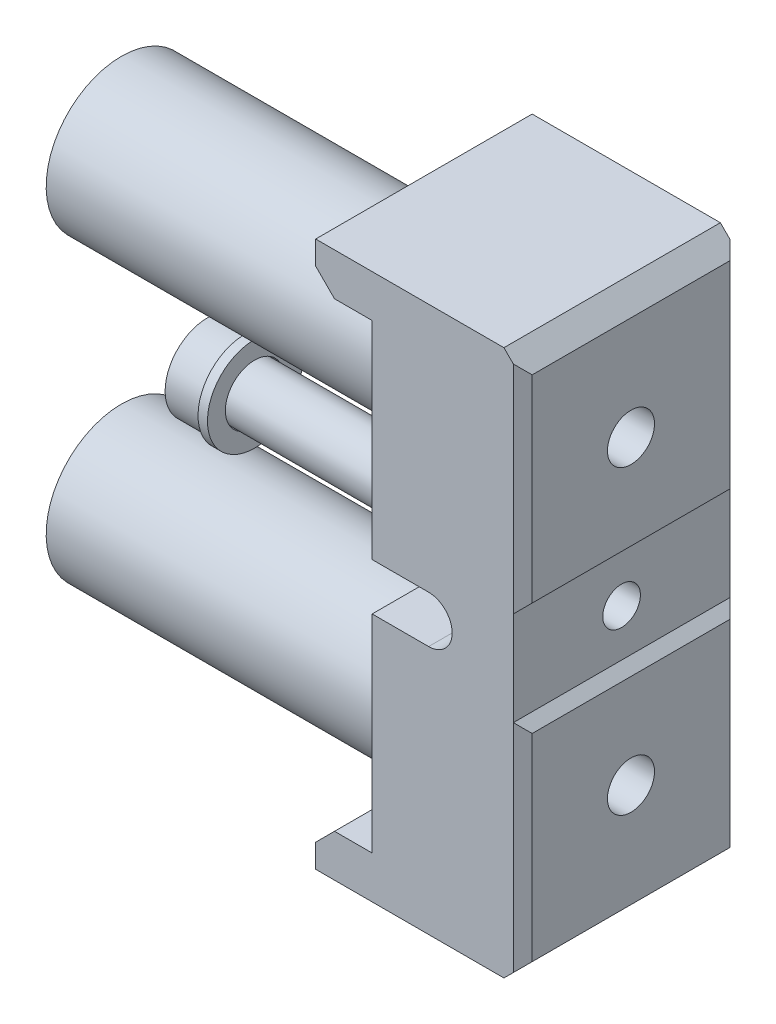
ISO-10303-21;
HEADER;
FILE_DESCRIPTION(('STEP AP214'),'2;1');
FILE_NAME('part.step','',(''),(''),'','','');
FILE_SCHEMA(('AUTOMOTIVE_DESIGN { 1 0 10303 214 1 1 1 1 }'));
ENDSEC;
DATA;
#1=APPLICATION_CONTEXT('core data for automotive mechanical design processes');
#2=APPLICATION_PROTOCOL_DEFINITION('international standard','automotive_design',2000,#1);
#3=PRODUCT_CONTEXT('',#1,'mechanical');
#4=PRODUCT('Part','Part','',(#3));
#5=PRODUCT_RELATED_PRODUCT_CATEGORY('part','',(#4));
#6=PRODUCT_DEFINITION_FORMATION('','',#4);
#7=PRODUCT_DEFINITION_CONTEXT('part definition',#1,'design');
#8=PRODUCT_DEFINITION('design','',#6,#7);
#9=PRODUCT_DEFINITION_SHAPE('','',#8);
#10=(LENGTH_UNIT() NAMED_UNIT(*) SI_UNIT(.MILLI.,.METRE.));
#11=(NAMED_UNIT(*) PLANE_ANGLE_UNIT() SI_UNIT($,.RADIAN.));
#12=(NAMED_UNIT(*) SI_UNIT($,.STERADIAN.) SOLID_ANGLE_UNIT());
#13=UNCERTAINTY_MEASURE_WITH_UNIT(LENGTH_MEASURE(1.E-05),#10,'distance_accuracy_value','');
#14=(GEOMETRIC_REPRESENTATION_CONTEXT(3) GLOBAL_UNCERTAINTY_ASSIGNED_CONTEXT((#13)) GLOBAL_UNIT_ASSIGNED_CONTEXT((#10,
#11,#12)) REPRESENTATION_CONTEXT('',''));
#15=CARTESIAN_POINT('',(0.,0.,0.));
#16=DIRECTION('',(0.,0.,1.));
#17=DIRECTION('',(1.,0.,0.));
#18=AXIS2_PLACEMENT_3D('',#15,#16,#17);
#19=CARTESIAN_POINT('',(-13.0966869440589,-16.,-20.));
#20=DIRECTION('',(1.,0.,0.));
#21=DIRECTION('',(0.,-1.,0.));
#22=AXIS2_PLACEMENT_3D('',#19,#20,#21);
#23=PLANE('',#22);
#24=CARTESIAN_POINT('',(-13.0966869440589,-16.,-20.));
#25=DIRECTION('',(-1.,0.,0.));
#26=DIRECTION('',(0.,1.,0.));
#27=AXIS2_PLACEMENT_3D('',#24,#25,#26);
#28=CIRCLE('',#27,4.25);
#29=CARTESIAN_POINT('',(-13.0966869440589,-11.75,-20.));
#30=VERTEX_POINT('',#29);
#31=EDGE_CURVE('E1061',#30,#30,#28,.T.);
#32=ORIENTED_EDGE('',*,*,#31,.T.);
#33=EDGE_LOOP('',(#32));
#34=FACE_BOUND('',#33,.T.);
#35=ADVANCED_FACE('F17',(#34),#23,.F.);
#36=CARTESIAN_POINT('',(-6.5966869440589,-16.,-20.));
#37=DIRECTION('',(-1.,0.,0.));
#38=DIRECTION('',(0.,1.,0.));
#39=AXIS2_PLACEMENT_3D('',#36,#37,#38);
#40=CYLINDRICAL_SURFACE('',#39,4.25);
#41=CARTESIAN_POINT('',(-23.9966869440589,-16.,-20.));
#42=DIRECTION('',(1.,0.,0.));
#43=DIRECTION('',(0.,-1.,0.));
#44=AXIS2_PLACEMENT_3D('',#41,#42,#43);
#45=CIRCLE('',#44,4.25);
#46=CARTESIAN_POINT('',(-23.9966869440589,-20.25,-20.));
#47=VERTEX_POINT('',#46);
#48=EDGE_CURVE('E231',#47,#47,#45,.T.);
#49=ORIENTED_EDGE('',*,*,#48,.F.);
#50=EDGE_LOOP('',(#49));
#51=FACE_BOUND('',#50,.T.);
#52=ORIENTED_EDGE('',*,*,#31,.F.);
#53=EDGE_LOOP('',(#52));
#54=FACE_BOUND('',#53,.T.);
#55=ADVANCED_FACE('F866',(#51,#54),#40,.F.);
#56=CARTESIAN_POINT('',(-23.9966869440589,-16.,-24.25));
#57=DIRECTION('',(-1.,0.,0.));
#58=DIRECTION('',(0.,1.,0.));
#59=AXIS2_PLACEMENT_3D('',#56,#57,#58);
#60=PLANE('',#59);
#61=ORIENTED_EDGE('',*,*,#48,.T.);
#62=EDGE_LOOP('',(#61));
#63=FACE_BOUND('',#62,.T.);
#64=CARTESIAN_POINT('',(-23.9966869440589,-16.,-20.));
#65=DIRECTION('',(1.,0.,0.));
#66=DIRECTION('',(0.,-1.,0.));
#67=AXIS2_PLACEMENT_3D('',#64,#65,#66);
#68=CIRCLE('',#67,6.25);
#69=CARTESIAN_POINT('',(-23.9966869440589,-22.25,-20.));
#70=VERTEX_POINT('',#69);
#71=EDGE_CURVE('E1063',#70,#70,#68,.T.);
#72=ORIENTED_EDGE('',*,*,#71,.F.);
#73=EDGE_LOOP('',(#72));
#74=FACE_BOUND('',#73,.T.);
#75=ADVANCED_FACE('F858',(#63,#74),#60,.T.);
#76=CARTESIAN_POINT('',(-6.5966869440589,-16.,-20.));
#77=DIRECTION('',(1.,0.,0.));
#78=DIRECTION('',(0.,-1.,0.));
#79=AXIS2_PLACEMENT_3D('',#76,#77,#78);
#80=CYLINDRICAL_SURFACE('',#79,6.25);
#81=ORIENTED_EDGE('',*,*,#71,.T.);
#82=EDGE_LOOP('',(#81));
#83=FACE_BOUND('',#82,.T.);
#84=CARTESIAN_POINT('',(-48.5966869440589,-16.,-20.));
#85=DIRECTION('',(-1.,0.,0.));
#86=DIRECTION('',(0.,1.,0.));
#87=AXIS2_PLACEMENT_3D('',#84,#85,#86);
#88=CIRCLE('',#87,6.25);
#89=CARTESIAN_POINT('',(-48.5966869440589,-9.75,-20.));
#90=VERTEX_POINT('',#89);
#91=EDGE_CURVE('E1080',#90,#90,#88,.F.);
#92=ORIENTED_EDGE('',*,*,#91,.F.);
#93=EDGE_LOOP('',(#92));
#94=FACE_BOUND('',#93,.T.);
#95=ADVANCED_FACE('F850',(#83,#94),#80,.F.);
#96=CARTESIAN_POINT('',(-48.5966869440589,-16.,-28.));
#97=DIRECTION('',(-1.,0.,0.));
#98=DIRECTION('',(0.,1.,0.));
#99=AXIS2_PLACEMENT_3D('',#96,#97,#98);
#100=PLANE('',#99);
#101=CARTESIAN_POINT('',(-48.5966869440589,-16.,-20.));
#102=DIRECTION('',(-1.,0.,0.));
#103=DIRECTION('',(0.,1.,0.));
#104=AXIS2_PLACEMENT_3D('',#101,#102,#103);
#105=CIRCLE('',#104,8.);
#106=CARTESIAN_POINT('',(-48.5966869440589,-8.,-20.));
#107=VERTEX_POINT('',#106);
#108=EDGE_CURVE('E1073',#107,#107,#105,.T.);
#109=ORIENTED_EDGE('',*,*,#108,.T.);
#110=EDGE_LOOP('',(#109));
#111=FACE_BOUND('',#110,.T.);
#112=ORIENTED_EDGE('',*,*,#91,.T.);
#113=EDGE_LOOP('',(#112));
#114=FACE_BOUND('',#113,.T.);
#115=ADVANCED_FACE('F842',(#111,#114),#100,.T.);
#116=CARTESIAN_POINT('',(-6.5966869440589,-16.,-20.));
#117=DIRECTION('',(-1.,0.,0.));
#118=DIRECTION('',(0.,1.,0.));
#119=AXIS2_PLACEMENT_3D('',#116,#117,#118);
#120=CYLINDRICAL_SURFACE('',#119,8.);
#121=ORIENTED_EDGE('',*,*,#108,.F.);
#122=EDGE_LOOP('',(#121));
#123=FACE_BOUND('',#122,.T.);
#124=CARTESIAN_POINT('',(-9.18492506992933,-16.,-20.));
#125=DIRECTION('',(-0.93969262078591,0.,-0.342020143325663));
#126=DIRECTION('',(-0.342020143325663,0.,0.939692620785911));
#127=AXIS2_PLACEMENT_3D('',#124,#125,#126);
#128=ELLIPSE('',#127,8.51342217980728,8.);
#129=CARTESIAN_POINT('',(-6.5966869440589,-12.3350457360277,-27.1111258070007));
#130=VERTEX_POINT('',#129);
#131=CARTESIAN_POINT('',(-10.458820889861,-8.80625271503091,-16.5));
#132=VERTEX_POINT('',#131);
#133=EDGE_CURVE('E1067',#130,#132,#128,.F.);
#134=ORIENTED_EDGE('',*,*,#133,.F.);
#135=CARTESIAN_POINT('',(-6.5966869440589,-16.,-20.));
#136=DIRECTION('',(-1.,0.,0.));
#137=DIRECTION('',(0.,1.,0.));
#138=AXIS2_PLACEMENT_3D('',#135,#136,#137);
#139=CIRCLE('',#138,8.);
#140=CARTESIAN_POINT('',(-6.5966869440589,-19.6649542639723,-27.1111258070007));
#141=VERTEX_POINT('',#140);
#142=EDGE_CURVE('E1076',#130,#141,#139,.T.);
#143=ORIENTED_EDGE('',*,*,#142,.T.);
#144=CARTESIAN_POINT('',(-10.458820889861,-23.193747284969,-16.5));
#145=VERTEX_POINT('',#144);
#146=EDGE_CURVE('E36',#145,#141,#128,.F.);
#147=ORIENTED_EDGE('',*,*,#146,.F.);
#148=EDGE_CURVE('E1065',#132,#145,#128,.F.);
#149=ORIENTED_EDGE('',*,*,#148,.F.);
#150=EDGE_LOOP('',(#134,#143,#147,#149));
#151=FACE_BOUND('',#150,.T.);
#152=ADVANCED_FACE('F835',(#123,#151),#120,.T.);
#153=CARTESIAN_POINT('',(-12.0966869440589,-1.,-12.));
#154=DIRECTION('',(-0.93969262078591,0.,-0.342020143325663));
#155=DIRECTION('',(0.342020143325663,0.,-0.93969262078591));
#156=AXIS2_PLACEMENT_3D('',#153,#154,#155);
#157=PLANE('',#156);
#158=DIRECTION('',(0.,-1.,0.));
#159=VECTOR('',#158,1.);
#160=CARTESIAN_POINT('',(-10.458820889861,-1.,-16.5));
#161=LINE('',#160,#159);
#162=EDGE_CURVE('E27',#132,#145,#161,.T.);
#163=ORIENTED_EDGE('',*,*,#162,.F.);
#164=ORIENTED_EDGE('',*,*,#148,.T.);
#165=EDGE_LOOP('',(#163,#164));
#166=FACE_BOUND('',#165,.T.);
#167=ADVANCED_FACE('F375',(#166),#157,.F.);
#168=CARTESIAN_POINT('',(-6.5966869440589,-16.,-20.));
#169=DIRECTION('',(1.,0.,0.));
#170=DIRECTION('',(0.,-1.,0.));
#171=AXIS2_PLACEMENT_3D('',#168,#169,#170);
#172=PLANE('',#171);
#173=DIRECTION('',(0.,1.,0.));
#174=VECTOR('',#173,1.);
#175=CARTESIAN_POINT('',(-6.5966869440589,-16.,-27.1111258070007));
#176=LINE('',#175,#174);
#177=EDGE_CURVE('E1078',#141,#130,#176,.T.);
#178=ORIENTED_EDGE('',*,*,#177,.F.);
#179=ORIENTED_EDGE('',*,*,#142,.F.);
#180=EDGE_LOOP('',(#178,#179));
#181=FACE_BOUND('',#180,.T.);
#182=ADVANCED_FACE('F372',(#181),#172,.T.);
#183=CARTESIAN_POINT('',(-9.18492506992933,-16.,-20.));
#184=DIRECTION('',(0.939692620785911,0.,0.342020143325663));
#185=DIRECTION('',(0.342020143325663,0.,-0.939692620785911));
#186=AXIS2_PLACEMENT_3D('',#183,#184,#185);
#187=ELLIPSE('',#186,2.66044443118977,2.5);
#188=CARTESIAN_POINT('',(-8.27499948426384,-16.,-22.5));
#189=VERTEX_POINT('',#188);
#190=EDGE_CURVE('E11',#189,#189,#187,.T.);
#191=ORIENTED_EDGE('',*,*,#190,.T.);
#192=EDGE_LOOP('',(#191));
#193=FACE_BOUND('',#192,.T.);
#194=ADVANCED_FACE('F362',(#193),#157,.F.);
#195=CARTESIAN_POINT('',(-39.458820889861,0.,-20.));
#196=DIRECTION('',(-1.,0.,0.));
#197=DIRECTION('',(0.,-1.,0.));
#198=AXIS2_PLACEMENT_3D('',#195,#196,#197);
#199=PLANE('',#198);
#200=CARTESIAN_POINT('',(-39.458820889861,0.,-20.));
#201=DIRECTION('',(-1.,0.,0.));
#202=DIRECTION('',(0.,-1.,0.));
#203=AXIS2_PLACEMENT_3D('',#200,#201,#202);
#204=CIRCLE('',#203,4.5);
#205=CARTESIAN_POINT('',(-39.458820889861,-4.5,-20.));
#206=VERTEX_POINT('',#205);
#207=EDGE_CURVE('E467',#206,#206,#204,.T.);
#208=ORIENTED_EDGE('',*,*,#207,.T.);
#209=EDGE_LOOP('',(#208));
#210=FACE_BOUND('',#209,.T.);
#211=ADVANCED_FACE('F347',(#210),#199,.T.);
#212=CARTESIAN_POINT('',(-35.458820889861,0.,-20.));
#213=DIRECTION('',(1.,0.,0.));
#214=DIRECTION('',(0.,1.,0.));
#215=AXIS2_PLACEMENT_3D('',#212,#213,#214);
#216=CYLINDRICAL_SURFACE('',#215,4.5);
#217=ORIENTED_EDGE('',*,*,#207,.F.);
#218=EDGE_LOOP('',(#217));
#219=FACE_BOUND('',#218,.T.);
#220=CARTESIAN_POINT('',(-35.458820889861,0.,-20.));
#221=DIRECTION('',(1.,0.,0.));
#222=DIRECTION('',(0.,1.,0.));
#223=AXIS2_PLACEMENT_3D('',#220,#221,#222);
#224=CIRCLE('',#223,4.5);
#225=CARTESIAN_POINT('',(-35.458820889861,4.5,-20.));
#226=VERTEX_POINT('',#225);
#227=EDGE_CURVE('E222',#226,#226,#224,.F.);
#228=ORIENTED_EDGE('',*,*,#227,.T.);
#229=EDGE_LOOP('',(#228));
#230=FACE_BOUND('',#229,.T.);
#231=ADVANCED_FACE('F262',(#219,#230),#216,.T.);
#232=CARTESIAN_POINT('',(-13.0966869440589,16.,-20.));
#233=DIRECTION('',(1.,0.,0.));
#234=DIRECTION('',(0.,-1.,0.));
#235=AXIS2_PLACEMENT_3D('',#232,#233,#234);
#236=PLANE('',#235);
#237=CARTESIAN_POINT('',(-13.0966869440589,16.,-20.));
#238=DIRECTION('',(-1.,0.,0.));
#239=DIRECTION('',(0.,1.,0.));
#240=AXIS2_PLACEMENT_3D('',#237,#238,#239);
#241=CIRCLE('',#240,4.25);
#242=CARTESIAN_POINT('',(-13.0966869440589,20.25,-20.));
#243=VERTEX_POINT('',#242);
#244=EDGE_CURVE('E1086',#243,#243,#241,.T.);
#245=ORIENTED_EDGE('',*,*,#244,.T.);
#246=EDGE_LOOP('',(#245));
#247=FACE_BOUND('',#246,.T.);
#248=ADVANCED_FACE('F250',(#247),#236,.F.);
#249=CARTESIAN_POINT('',(-35.458820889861,0.,-20.));
#250=DIRECTION('',(1.,0.,0.));
#251=DIRECTION('',(0.,-1.,0.));
#252=AXIS2_PLACEMENT_3D('',#249,#250,#251);
#253=PLANE('',#252);
#254=ORIENTED_EDGE('',*,*,#227,.F.);
#255=EDGE_LOOP('',(#254));
#256=FACE_BOUND('',#255,.T.);
#257=CARTESIAN_POINT('',(-35.458820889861,0.,-20.));
#258=DIRECTION('',(1.,0.,0.));
#259=DIRECTION('',(0.,-1.,0.));
#260=AXIS2_PLACEMENT_3D('',#257,#258,#259);
#261=CIRCLE('',#260,5.);
#262=CARTESIAN_POINT('',(-35.458820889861,-5.,-20.));
#263=VERTEX_POINT('',#262);
#264=EDGE_CURVE('E21',#263,#263,#261,.T.);
#265=ORIENTED_EDGE('',*,*,#264,.F.);
#266=EDGE_LOOP('',(#265));
#267=FACE_BOUND('',#266,.T.);
#268=ADVANCED_FACE('F247',(#256,#267),#253,.F.);
#269=CARTESIAN_POINT('',(-6.5966869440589,16.,-20.));
#270=DIRECTION('',(-1.,0.,0.));
#271=DIRECTION('',(0.,1.,0.));
#272=AXIS2_PLACEMENT_3D('',#269,#270,#271);
#273=CYLINDRICAL_SURFACE('',#272,4.25);
#274=CARTESIAN_POINT('',(-23.9966869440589,16.,-20.));
#275=DIRECTION('',(1.,0.,0.));
#276=DIRECTION('',(0.,-1.,0.));
#277=AXIS2_PLACEMENT_3D('',#274,#275,#276);
#278=CIRCLE('',#277,4.25);
#279=CARTESIAN_POINT('',(-23.9966869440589,11.75,-20.));
#280=VERTEX_POINT('',#279);
#281=EDGE_CURVE('E461',#280,#280,#278,.T.);
#282=ORIENTED_EDGE('',*,*,#281,.F.);
#283=EDGE_LOOP('',(#282));
#284=FACE_BOUND('',#283,.T.);
#285=ORIENTED_EDGE('',*,*,#244,.F.);
#286=EDGE_LOOP('',(#285));
#287=FACE_BOUND('',#286,.T.);
#288=ADVANCED_FACE('F249',(#284,#287),#273,.F.);
#289=CARTESIAN_POINT('',(-34.458820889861,0.,-20.));
#290=DIRECTION('',(-1.,0.,0.));
#291=DIRECTION('',(0.,1.,0.));
#292=AXIS2_PLACEMENT_3D('',#289,#290,#291);
#293=CYLINDRICAL_SURFACE('',#292,5.);
#294=CARTESIAN_POINT('',(-34.458820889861,0.,-20.));
#295=DIRECTION('',(1.,0.,0.));
#296=DIRECTION('',(0.,-1.,0.));
#297=AXIS2_PLACEMENT_3D('',#294,#295,#296);
#298=CIRCLE('',#297,5.);
#299=CARTESIAN_POINT('',(-34.458820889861,-5.,-20.));
#300=VERTEX_POINT('',#299);
#301=EDGE_CURVE('E235',#300,#300,#298,.T.);
#302=ORIENTED_EDGE('',*,*,#301,.F.);
#303=EDGE_LOOP('',(#302));
#304=FACE_BOUND('',#303,.T.);
#305=ORIENTED_EDGE('',*,*,#264,.T.);
#306=EDGE_LOOP('',(#305));
#307=FACE_BOUND('',#306,.T.);
#308=ADVANCED_FACE('F19',(#304,#307),#293,.T.);
#309=CARTESIAN_POINT('',(-12.0966869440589,31.,-12.));
#310=DIRECTION('',(-0.93969262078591,0.,-0.342020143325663));
#311=DIRECTION('',(0.342020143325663,0.,-0.93969262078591));
#312=AXIS2_PLACEMENT_3D('',#309,#310,#311);
#313=PLANE('',#312);
#314=CARTESIAN_POINT('',(-9.18492506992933,16.,-20.));
#315=DIRECTION('',(0.939692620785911,0.,0.342020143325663));
#316=DIRECTION('',(0.342020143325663,0.,-0.939692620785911));
#317=AXIS2_PLACEMENT_3D('',#314,#315,#316);
#318=ELLIPSE('',#317,2.66044443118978,2.5);
#319=CARTESIAN_POINT('',(-8.27499948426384,16.,-22.5));
#320=VERTEX_POINT('',#319);
#321=EDGE_CURVE('E228',#320,#320,#318,.T.);
#322=ORIENTED_EDGE('',*,*,#321,.T.);
#323=EDGE_LOOP('',(#322));
#324=FACE_BOUND('',#323,.T.);
#325=ADVANCED_FACE('F269',(#324),#313,.F.);
#326=CARTESIAN_POINT('',(-23.9966869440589,16.,-24.25));
#327=DIRECTION('',(-1.,0.,0.));
#328=DIRECTION('',(0.,1.,0.));
#329=AXIS2_PLACEMENT_3D('',#326,#327,#328);
#330=PLANE('',#329);
#331=ORIENTED_EDGE('',*,*,#281,.T.);
#332=EDGE_LOOP('',(#331));
#333=FACE_BOUND('',#332,.T.);
#334=CARTESIAN_POINT('',(-23.9966869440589,16.,-20.));
#335=DIRECTION('',(1.,0.,0.));
#336=DIRECTION('',(0.,-1.,0.));
#337=AXIS2_PLACEMENT_3D('',#334,#335,#336);
#338=CIRCLE('',#337,6.25);
#339=CARTESIAN_POINT('',(-23.9966869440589,9.75,-20.));
#340=VERTEX_POINT('',#339);
#341=EDGE_CURVE('E465',#340,#340,#338,.T.);
#342=ORIENTED_EDGE('',*,*,#341,.F.);
#343=EDGE_LOOP('',(#342));
#344=FACE_BOUND('',#343,.T.);
#345=ADVANCED_FACE('F261',(#333,#344),#330,.T.);
#346=CARTESIAN_POINT('',(-34.458820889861,0.,-20.));
#347=DIRECTION('',(1.,0.,0.));
#348=DIRECTION('',(0.,-1.,0.));
#349=AXIS2_PLACEMENT_3D('',#346,#347,#348);
#350=PLANE('',#349);
#351=ORIENTED_EDGE('',*,*,#301,.T.);
#352=EDGE_LOOP('',(#351));
#353=FACE_BOUND('',#352,.T.);
#354=CARTESIAN_POINT('',(-34.458820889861,0.,-20.));
#355=DIRECTION('',(1.,0.,0.));
#356=DIRECTION('',(0.,-1.,0.));
#357=AXIS2_PLACEMENT_3D('',#354,#355,#356);
#358=CIRCLE('',#357,3.1);
#359=CARTESIAN_POINT('',(-34.458820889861,-3.1,-20.));
#360=VERTEX_POINT('',#359);
#361=EDGE_CURVE('E233',#360,#360,#358,.T.);
#362=ORIENTED_EDGE('',*,*,#361,.F.);
#363=EDGE_LOOP('',(#362));
#364=FACE_BOUND('',#363,.T.);
#365=ADVANCED_FACE('F252',(#353,#364),#350,.T.);
#366=CARTESIAN_POINT('',(-16.458820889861,16.,-20.));
#367=DIRECTION('',(1.,0.,0.));
#368=DIRECTION('',(0.,-1.,0.));
#369=AXIS2_PLACEMENT_3D('',#366,#367,#368);
#370=CYLINDRICAL_SURFACE('',#369,2.5);
#371=CARTESIAN_POINT('',(5.54117911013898,16.,-20.));
#372=DIRECTION('',(1.,0.,0.));
#373=DIRECTION('',(0.,-1.,0.));
#374=AXIS2_PLACEMENT_3D('',#371,#372,#373);
#375=CIRCLE('',#374,2.5);
#376=CARTESIAN_POINT('',(5.54117911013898,13.5,-20.));
#377=VERTEX_POINT('',#376);
#378=EDGE_CURVE('E472',#377,#377,#375,.T.);
#379=ORIENTED_EDGE('',*,*,#378,.T.);
#380=EDGE_LOOP('',(#379));
#381=FACE_BOUND('',#380,.T.);
#382=ORIENTED_EDGE('',*,*,#321,.F.);
#383=EDGE_LOOP('',(#382));
#384=FACE_BOUND('',#383,.T.);
#385=ADVANCED_FACE('F273',(#381,#384),#370,.F.);
#386=CARTESIAN_POINT('',(1.541179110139,0.,-20.));
#387=DIRECTION('',(1.,0.,0.));
#388=DIRECTION('',(0.,1.,0.));
#389=AXIS2_PLACEMENT_3D('',#386,#387,#388);
#390=PLANE('',#389);
#391=CARTESIAN_POINT('',(1.541179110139,0.,-20.));
#392=DIRECTION('',(1.,0.,0.));
#393=DIRECTION('',(0.,1.,0.));
#394=AXIS2_PLACEMENT_3D('',#391,#392,#393);
#395=CIRCLE('',#394,2.);
#396=CARTESIAN_POINT('',(1.541179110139,2.,-20.));
#397=VERTEX_POINT('',#396);
#398=EDGE_CURVE('E1106',#397,#397,#395,.T.);
#399=ORIENTED_EDGE('',*,*,#398,.T.);
#400=EDGE_LOOP('',(#399));
#401=FACE_BOUND('',#400,.T.);
#402=ADVANCED_FACE('F357',(#401),#390,.T.);
#403=CARTESIAN_POINT('',(-6.5966869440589,16.,-20.));
#404=DIRECTION('',(1.,0.,0.));
#405=DIRECTION('',(0.,-1.,0.));
#406=AXIS2_PLACEMENT_3D('',#403,#404,#405);
#407=CYLINDRICAL_SURFACE('',#406,6.25);
#408=ORIENTED_EDGE('',*,*,#341,.T.);
#409=EDGE_LOOP('',(#408));
#410=FACE_BOUND('',#409,.T.);
#411=CARTESIAN_POINT('',(-48.5966869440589,16.,-20.));
#412=DIRECTION('',(-1.,0.,0.));
#413=DIRECTION('',(0.,1.,0.));
#414=AXIS2_PLACEMENT_3D('',#411,#412,#413);
#415=CIRCLE('',#414,6.25);
#416=CARTESIAN_POINT('',(-48.5966869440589,22.25,-20.));
#417=VERTEX_POINT('',#416);
#418=EDGE_CURVE('E1102',#417,#417,#415,.F.);
#419=ORIENTED_EDGE('',*,*,#418,.F.);
#420=EDGE_LOOP('',(#419));
#421=FACE_BOUND('',#420,.T.);
#422=ADVANCED_FACE('F345',(#410,#421),#407,.F.);
#423=CARTESIAN_POINT('',(-34.458820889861,0.,-20.));
#424=DIRECTION('',(-1.,0.,0.));
#425=DIRECTION('',(0.,1.,0.));
#426=AXIS2_PLACEMENT_3D('',#423,#424,#425);
#427=CYLINDRICAL_SURFACE('',#426,3.1);
#428=ORIENTED_EDGE('',*,*,#361,.T.);
#429=EDGE_LOOP('',(#428));
#430=FACE_BOUND('',#429,.T.);
#431=CARTESIAN_POINT('',(-35.458820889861,0.,-20.));
#432=DIRECTION('',(1.,0.,0.));
#433=DIRECTION('',(0.,0.,-1.));
#434=AXIS2_PLACEMENT_3D('',#431,#432,#433);
#435=CIRCLE('',#434,3.1);
#436=CARTESIAN_POINT('',(-35.458820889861,0.,-23.1));
#437=VERTEX_POINT('',#436);
#438=EDGE_CURVE('E460',#437,#437,#435,.F.);
#439=ORIENTED_EDGE('',*,*,#438,.T.);
#440=EDGE_LOOP('',(#439));
#441=FACE_BOUND('',#440,.T.);
#442=ADVANCED_FACE('F271',(#430,#441),#427,.F.);
#443=CARTESIAN_POINT('',(5.54117911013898,0.,-8.5));
#444=DIRECTION('',(-1.,0.,0.));
#445=DIRECTION('',(0.,1.,0.));
#446=AXIS2_PLACEMENT_3D('',#443,#444,#445);
#447=PLANE('',#446);
#448=ORIENTED_EDGE('',*,*,#378,.F.);
#449=EDGE_LOOP('',(#448));
#450=FACE_BOUND('',#449,.T.);
#451=DIRECTION('',(0.,0.,1.));
#452=VECTOR('',#451,1.);
#453=CARTESIAN_POINT('',(5.54117911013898,27.,-8.5));
#454=LINE('',#453,#452);
#455=CARTESIAN_POINT('',(5.54117911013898,27.,-30.5));
#456=VERTEX_POINT('',#455);
#457=CARTESIAN_POINT('',(5.54117911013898,27.,-9.5));
#458=VERTEX_POINT('',#457);
#459=EDGE_CURVE('E578',#456,#458,#454,.T.);
#460=ORIENTED_EDGE('',*,*,#459,.T.);
#461=DIRECTION('',(0.,-1.,0.));
#462=VECTOR('',#461,1.);
#463=CARTESIAN_POINT('',(5.54117911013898,0.,-9.5));
#464=LINE('',#463,#462);
#465=CARTESIAN_POINT('',(5.54117911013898,6.,-9.5));
#466=VERTEX_POINT('',#465);
#467=EDGE_CURVE('E587',#458,#466,#464,.T.);
#468=ORIENTED_EDGE('',*,*,#467,.T.);
#469=DIRECTION('',(0.,0.,-1.));
#470=VECTOR('',#469,1.);
#471=CARTESIAN_POINT('',(5.54117911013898,6.,-8.5));
#472=LINE('',#471,#470);
#473=CARTESIAN_POINT('',(5.54117911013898,6.,-30.5));
#474=VERTEX_POINT('',#473);
#475=EDGE_CURVE('E508',#466,#474,#472,.T.);
#476=ORIENTED_EDGE('',*,*,#475,.T.);
#477=DIRECTION('',(0.,1.,0.));
#478=VECTOR('',#477,1.);
#479=CARTESIAN_POINT('',(5.54117911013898,0.,-30.5));
#480=LINE('',#479,#478);
#481=EDGE_CURVE('E584',#474,#456,#480,.T.);
#482=ORIENTED_EDGE('',*,*,#481,.T.);
#483=EDGE_LOOP('',(#460,#468,#476,#482));
#484=FACE_BOUND('',#483,.T.);
#485=ADVANCED_FACE('F344',(#450,#484),#447,.F.);
#486=CARTESIAN_POINT('',(5.54117911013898,6.,-8.5));
#487=DIRECTION('',(-0.707106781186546,0.707106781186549,0.));
#488=DIRECTION('',(0.707106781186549,0.707106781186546,0.));
#489=AXIS2_PLACEMENT_3D('',#486,#487,#488);
#490=PLANE('',#489);
#491=ORIENTED_EDGE('',*,*,#475,.F.);
#492=DIRECTION('',(0.577350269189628,0.577350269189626,-0.577350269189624));
#493=VECTOR('',#492,1.);
#494=CARTESIAN_POINT('',(3.54117911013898,4.,-7.5));
#495=LINE('',#494,#493);
#496=CARTESIAN_POINT('',(4.54117911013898,5.,-8.5));
#497=VERTEX_POINT('',#496);
#498=EDGE_CURVE('E592',#466,#497,#495,.F.);
#499=ORIENTED_EDGE('',*,*,#498,.T.);
#500=DIRECTION('',(0.,0.,-1.));
#501=VECTOR('',#500,1.);
#502=CARTESIAN_POINT('',(4.54117911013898,5.,-8.5));
#503=LINE('',#502,#501);
#504=CARTESIAN_POINT('',(4.54117911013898,5.,-31.5));
#505=VERTEX_POINT('',#504);
#506=EDGE_CURVE('E512',#497,#505,#503,.T.);
#507=ORIENTED_EDGE('',*,*,#506,.T.);
#508=DIRECTION('',(-0.577350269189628,-0.577350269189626,-0.577350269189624));
#509=VECTOR('',#508,1.);
#510=CARTESIAN_POINT('',(3.54117911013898,4.,-32.5));
#511=LINE('',#510,#509);
#512=EDGE_CURVE('E590',#505,#474,#511,.F.);
#513=ORIENTED_EDGE('',*,*,#512,.T.);
#514=EDGE_LOOP('',(#491,#499,#507,#513));
#515=FACE_BOUND('',#514,.T.);
#516=ADVANCED_FACE('F353',(#515),#490,.F.);
#517=CARTESIAN_POINT('',(-16.458820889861,0.,-20.));
#518=DIRECTION('',(1.,0.,0.));
#519=DIRECTION('',(0.,-1.,0.));
#520=AXIS2_PLACEMENT_3D('',#517,#518,#519);
#521=CYLINDRICAL_SURFACE('',#520,2.);
#522=ORIENTED_EDGE('',*,*,#398,.F.);
#523=EDGE_LOOP('',(#522));
#524=FACE_BOUND('',#523,.T.);
#525=CARTESIAN_POINT('',(4.54117911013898,0.,-20.));
#526=DIRECTION('',(1.,0.,0.));
#527=DIRECTION('',(0.,-1.,0.));
#528=AXIS2_PLACEMENT_3D('',#525,#526,#527);
#529=CIRCLE('',#528,2.);
#530=CARTESIAN_POINT('',(4.54117911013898,-2.,-20.));
#531=VERTEX_POINT('',#530);
#532=EDGE_CURVE('E237',#531,#531,#529,.T.);
#533=ORIENTED_EDGE('',*,*,#532,.T.);
#534=EDGE_LOOP('',(#533));
#535=FACE_BOUND('',#534,.T.);
#536=ADVANCED_FACE('F332',(#524,#535),#521,.F.);
#537=CARTESIAN_POINT('',(5.54117911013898,0.,-30.5));
#538=DIRECTION('',(-0.707106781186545,0.,0.70710678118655));
#539=DIRECTION('',(0.,1.,0.));
#540=AXIS2_PLACEMENT_3D('',#537,#538,#539);
#541=PLANE('',#540);
#542=ORIENTED_EDGE('',*,*,#512,.F.);
#543=DIRECTION('',(0.,-1.,0.));
#544=VECTOR('',#543,1.);
#545=CARTESIAN_POINT('',(4.54117911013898,-29.,-31.5));
#546=LINE('',#545,#544);
#547=CARTESIAN_POINT('',(4.54117911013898,28.,-31.5));
#548=VERTEX_POINT('',#547);
#549=EDGE_CURVE('E616',#548,#505,#546,.T.);
#550=ORIENTED_EDGE('',*,*,#549,.F.);
#551=DIRECTION('',(-0.577350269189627,0.577350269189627,-0.577350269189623));
#552=VECTOR('',#551,1.);
#553=CARTESIAN_POINT('',(12.8745124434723,19.6666666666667,-23.1666666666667));
#554=LINE('',#553,#552);
#555=EDGE_CURVE('E598',#456,#548,#554,.T.);
#556=ORIENTED_EDGE('',*,*,#555,.F.);
#557=ORIENTED_EDGE('',*,*,#481,.F.);
#558=EDGE_LOOP('',(#542,#550,#556,#557));
#559=FACE_BOUND('',#558,.T.);
#560=ADVANCED_FACE('F328',(#559),#541,.F.);
#561=CARTESIAN_POINT('',(-48.5966869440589,16.,-28.));
#562=DIRECTION('',(-1.,0.,0.));
#563=DIRECTION('',(0.,1.,0.));
#564=AXIS2_PLACEMENT_3D('',#561,#562,#563);
#565=PLANE('',#564);
#566=CARTESIAN_POINT('',(-48.5966869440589,16.,-20.));
#567=DIRECTION('',(-1.,0.,0.));
#568=DIRECTION('',(0.,1.,0.));
#569=AXIS2_PLACEMENT_3D('',#566,#567,#568);
#570=CIRCLE('',#569,8.);
#571=CARTESIAN_POINT('',(-48.5966869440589,24.,-20.));
#572=VERTEX_POINT('',#571);
#573=EDGE_CURVE('E1092',#572,#572,#570,.T.);
#574=ORIENTED_EDGE('',*,*,#573,.T.);
#575=EDGE_LOOP('',(#574));
#576=FACE_BOUND('',#575,.T.);
#577=ORIENTED_EDGE('',*,*,#418,.T.);
#578=EDGE_LOOP('',(#577));
#579=FACE_BOUND('',#578,.T.);
#580=ADVANCED_FACE('F331',(#576,#579),#565,.T.);
#581=CARTESIAN_POINT('',(-35.458820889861,0.,-17.));
#582=DIRECTION('',(1.,0.,0.));
#583=DIRECTION('',(0.,1.,0.));
#584=AXIS2_PLACEMENT_3D('',#581,#582,#583);
#585=PLANE('',#584);
#586=CARTESIAN_POINT('',(-35.458820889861,0.,-20.));
#587=DIRECTION('',(1.,0.,0.));
#588=DIRECTION('',(0.,1.,0.));
#589=AXIS2_PLACEMENT_3D('',#586,#587,#588);
#590=CIRCLE('',#589,3.);
#591=CARTESIAN_POINT('',(-35.458820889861,3.,-20.));
#592=VERTEX_POINT('',#591);
#593=EDGE_CURVE('E219',#592,#592,#590,.T.);
#594=ORIENTED_EDGE('',*,*,#593,.F.);
#595=EDGE_LOOP('',(#594));
#596=FACE_BOUND('',#595,.T.);
#597=ORIENTED_EDGE('',*,*,#438,.F.);
#598=EDGE_LOOP('',(#597));
#599=FACE_BOUND('',#598,.T.);
#600=ADVANCED_FACE('F326',(#596,#599),#585,.T.);
#601=CARTESIAN_POINT('',(5.54117911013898,0.,-30.5));
#602=DIRECTION('',(-0.707106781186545,0.,0.70710678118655));
#603=DIRECTION('',(0.,1.,0.));
#604=AXIS2_PLACEMENT_3D('',#601,#602,#603);
#605=PLANE('',#604);
#606=DIRECTION('',(-0.577350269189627,-0.577350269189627,-0.577350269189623));
#607=VECTOR('',#606,1.);
#608=CARTESIAN_POINT('',(12.8745124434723,-19.6666666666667,-23.1666666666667));
#609=LINE('',#608,#607);
#610=CARTESIAN_POINT('',(4.54117911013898,-28.,-31.5));
#611=VERTEX_POINT('',#610);
#612=CARTESIAN_POINT('',(5.54117911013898,-27.,-30.5));
#613=VERTEX_POINT('',#612);
#614=EDGE_CURVE('E608',#611,#613,#609,.F.);
#615=ORIENTED_EDGE('',*,*,#614,.F.);
#616=DIRECTION('',(0.,-1.,0.));
#617=VECTOR('',#616,1.);
#618=CARTESIAN_POINT('',(4.54117911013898,-29.,-31.5));
#619=LINE('',#618,#617);
#620=CARTESIAN_POINT('',(4.54117911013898,-5.,-31.5));
#621=VERTEX_POINT('',#620);
#622=EDGE_CURVE('E618',#621,#611,#619,.T.);
#623=ORIENTED_EDGE('',*,*,#622,.F.);
#624=DIRECTION('',(0.577350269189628,-0.577350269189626,0.577350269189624));
#625=VECTOR('',#624,1.);
#626=CARTESIAN_POINT('',(3.54117911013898,-4.,-32.5));
#627=LINE('',#626,#625);
#628=CARTESIAN_POINT('',(5.54117911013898,-6.,-30.5));
#629=VERTEX_POINT('',#628);
#630=EDGE_CURVE('E612',#629,#621,#627,.F.);
#631=ORIENTED_EDGE('',*,*,#630,.F.);
#632=DIRECTION('',(0.,1.,0.));
#633=VECTOR('',#632,1.);
#634=CARTESIAN_POINT('',(5.54117911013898,0.,-30.5));
#635=LINE('',#634,#633);
#636=EDGE_CURVE('E602',#613,#629,#635,.T.);
#637=ORIENTED_EDGE('',*,*,#636,.F.);
#638=EDGE_LOOP('',(#615,#623,#631,#637));
#639=FACE_BOUND('',#638,.T.);
#640=ADVANCED_FACE('F316',(#639),#605,.F.);
#641=CARTESIAN_POINT('',(5.54117911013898,27.,-8.5));
#642=DIRECTION('',(-0.707106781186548,-0.707106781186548,0.));
#643=DIRECTION('',(0.,0.,1.));
#644=AXIS2_PLACEMENT_3D('',#641,#642,#643);
#645=PLANE('',#644);
#646=DIRECTION('',(0.707106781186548,-0.707106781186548,0.));
#647=VECTOR('',#646,1.);
#648=CARTESIAN_POINT('',(5.54117911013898,27.,-8.5));
#649=LINE('',#648,#647);
#650=CARTESIAN_POINT('',(4.54117911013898,28.,-8.5));
#651=VERTEX_POINT('',#650);
#652=CARTESIAN_POINT('',(3.54117911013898,29.,-8.5));
#653=VERTEX_POINT('',#652);
#654=EDGE_CURVE('E573',#651,#653,#649,.F.);
#655=ORIENTED_EDGE('',*,*,#654,.F.);
#656=DIRECTION('',(0.577350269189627,-0.577350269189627,-0.577350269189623));
#657=VECTOR('',#656,1.);
#658=CARTESIAN_POINT('',(5.20784577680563,27.3333333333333,-9.16666666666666));
#659=LINE('',#658,#657);
#660=EDGE_CURVE('E600',#651,#458,#659,.T.);
#661=ORIENTED_EDGE('',*,*,#660,.T.);
#662=ORIENTED_EDGE('',*,*,#459,.F.);
#663=ORIENTED_EDGE('',*,*,#555,.T.);
#664=DIRECTION('',(-0.707106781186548,0.707106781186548,0.));
#665=VECTOR('',#664,1.);
#666=CARTESIAN_POINT('',(5.54117911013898,27.,-31.5));
#667=LINE('',#666,#665);
#668=CARTESIAN_POINT('',(3.54117911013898,29.,-31.5));
#669=VERTEX_POINT('',#668);
#670=EDGE_CURVE('E566',#669,#548,#667,.F.);
#671=ORIENTED_EDGE('',*,*,#670,.F.);
#672=DIRECTION('',(0.,0.,-1.));
#673=VECTOR('',#672,1.);
#674=CARTESIAN_POINT('',(3.54117911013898,29.,-8.5));
#675=LINE('',#674,#673);
#676=EDGE_CURVE('E581',#653,#669,#675,.T.);
#677=ORIENTED_EDGE('',*,*,#676,.F.);
#678=EDGE_LOOP('',(#655,#661,#662,#663,#671,#677));
#679=FACE_BOUND('',#678,.T.);
#680=ADVANCED_FACE('F312',(#679),#645,.F.);
#681=CARTESIAN_POINT('',(5.54117911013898,0.,-9.5));
#682=DIRECTION('',(-0.707106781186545,0.,-0.70710678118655));
#683=DIRECTION('',(0.,-1.,0.));
#684=AXIS2_PLACEMENT_3D('',#681,#682,#683);
#685=PLANE('',#684);
#686=ORIENTED_EDGE('',*,*,#660,.F.);
#687=DIRECTION('',(0.,1.,0.));
#688=VECTOR('',#687,1.);
#689=CARTESIAN_POINT('',(4.54117911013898,-29.,-8.5));
#690=LINE('',#689,#688);
#691=EDGE_CURVE('E596',#497,#651,#690,.T.);
#692=ORIENTED_EDGE('',*,*,#691,.F.);
#693=ORIENTED_EDGE('',*,*,#498,.F.);
#694=ORIENTED_EDGE('',*,*,#467,.F.);
#695=EDGE_LOOP('',(#686,#692,#693,#694));
#696=FACE_BOUND('',#695,.T.);
#697=ADVANCED_FACE('F315',(#696),#685,.F.);
#698=CARTESIAN_POINT('',(4.54117911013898,5.,-8.5));
#699=DIRECTION('',(-1.,0.,0.));
#700=DIRECTION('',(0.,1.,0.));
#701=AXIS2_PLACEMENT_3D('',#698,#699,#700);
#702=PLANE('',#701);
#703=ORIENTED_EDGE('',*,*,#532,.F.);
#704=EDGE_LOOP('',(#703));
#705=FACE_BOUND('',#704,.T.);
#706=DIRECTION('',(0.,1.,0.));
#707=VECTOR('',#706,1.);
#708=CARTESIAN_POINT('',(4.54117911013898,5.,-31.5));
#709=LINE('',#708,#707);
#710=EDGE_CURVE('E501',#621,#505,#709,.T.);
#711=ORIENTED_EDGE('',*,*,#710,.T.);
#712=ORIENTED_EDGE('',*,*,#506,.F.);
#713=DIRECTION('',(0.,1.,0.));
#714=VECTOR('',#713,1.);
#715=CARTESIAN_POINT('',(4.54117911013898,5.,-8.5));
#716=LINE('',#715,#714);
#717=CARTESIAN_POINT('',(4.54117911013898,-5.,-8.5));
#718=VERTEX_POINT('',#717);
#719=EDGE_CURVE('E502',#718,#497,#716,.T.);
#720=ORIENTED_EDGE('',*,*,#719,.F.);
#721=DIRECTION('',(0.,0.,-1.));
#722=VECTOR('',#721,1.);
#723=CARTESIAN_POINT('',(4.54117911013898,-5.,-8.5));
#724=LINE('',#723,#722);
#725=EDGE_CURVE('E515',#718,#621,#724,.T.);
#726=ORIENTED_EDGE('',*,*,#725,.T.);
#727=EDGE_LOOP('',(#711,#712,#720,#726));
#728=FACE_BOUND('',#727,.T.);
#729=ADVANCED_FACE('F305',(#705,#728),#702,.F.);
#730=CARTESIAN_POINT('',(5.54117911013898,0.,-9.5));
#731=DIRECTION('',(-0.707106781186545,0.,-0.70710678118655));
#732=DIRECTION('',(0.,-1.,0.));
#733=AXIS2_PLACEMENT_3D('',#730,#731,#732);
#734=PLANE('',#733);
#735=DIRECTION('',(-0.577350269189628,0.577350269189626,0.577350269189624));
#736=VECTOR('',#735,1.);
#737=CARTESIAN_POINT('',(3.54117911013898,-4.,-7.5));
#738=LINE('',#737,#736);
#739=CARTESIAN_POINT('',(5.54117911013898,-6.,-9.5));
#740=VERTEX_POINT('',#739);
#741=EDGE_CURVE('E614',#718,#740,#738,.F.);
#742=ORIENTED_EDGE('',*,*,#741,.F.);
#743=DIRECTION('',(0.,1.,0.));
#744=VECTOR('',#743,1.);
#745=CARTESIAN_POINT('',(4.54117911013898,-29.,-8.5));
#746=LINE('',#745,#744);
#747=CARTESIAN_POINT('',(4.54117911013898,-28.,-8.5));
#748=VERTEX_POINT('',#747);
#749=EDGE_CURVE('E594',#748,#718,#746,.T.);
#750=ORIENTED_EDGE('',*,*,#749,.F.);
#751=DIRECTION('',(0.577350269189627,0.577350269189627,-0.577350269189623));
#752=VECTOR('',#751,1.);
#753=CARTESIAN_POINT('',(5.20784577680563,-27.3333333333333,-9.16666666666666));
#754=LINE('',#753,#752);
#755=CARTESIAN_POINT('',(5.54117911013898,-27.,-9.5));
#756=VERTEX_POINT('',#755);
#757=EDGE_CURVE('E610',#756,#748,#754,.F.);
#758=ORIENTED_EDGE('',*,*,#757,.F.);
#759=DIRECTION('',(0.,-1.,0.));
#760=VECTOR('',#759,1.);
#761=CARTESIAN_POINT('',(5.54117911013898,0.,-9.5));
#762=LINE('',#761,#760);
#763=EDGE_CURVE('E605',#740,#756,#762,.T.);
#764=ORIENTED_EDGE('',*,*,#763,.F.);
#765=EDGE_LOOP('',(#742,#750,#758,#764));
#766=FACE_BOUND('',#765,.T.);
#767=ADVANCED_FACE('F310',(#766),#734,.F.);
#768=CARTESIAN_POINT('',(5.54117911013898,-27.,-8.5));
#769=DIRECTION('',(0.707106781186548,-0.707106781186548,0.));
#770=DIRECTION('',(0.,0.,1.));
#771=AXIS2_PLACEMENT_3D('',#768,#769,#770);
#772=PLANE('',#771);
#773=DIRECTION('',(0.,0.,-1.));
#774=VECTOR('',#773,1.);
#775=CARTESIAN_POINT('',(5.54117911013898,-27.,-31.5));
#776=LINE('',#775,#774);
#777=EDGE_CURVE('E561',#756,#613,#776,.T.);
#778=ORIENTED_EDGE('',*,*,#777,.F.);
#779=ORIENTED_EDGE('',*,*,#757,.T.);
#780=DIRECTION('',(0.707106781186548,0.707106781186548,0.));
#781=VECTOR('',#780,1.);
#782=CARTESIAN_POINT('',(5.54117911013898,-27.,-8.5));
#783=LINE('',#782,#781);
#784=CARTESIAN_POINT('',(3.54117911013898,-29.,-8.5));
#785=VERTEX_POINT('',#784);
#786=EDGE_CURVE('E575',#785,#748,#783,.T.);
#787=ORIENTED_EDGE('',*,*,#786,.F.);
#788=DIRECTION('',(0.,0.,1.));
#789=VECTOR('',#788,1.);
#790=CARTESIAN_POINT('',(3.54117911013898,-29.,-8.5));
#791=LINE('',#790,#789);
#792=CARTESIAN_POINT('',(3.54117911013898,-29.,-31.5));
#793=VERTEX_POINT('',#792);
#794=EDGE_CURVE('E571',#793,#785,#791,.T.);
#795=ORIENTED_EDGE('',*,*,#794,.F.);
#796=DIRECTION('',(-0.707106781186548,-0.707106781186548,0.));
#797=VECTOR('',#796,1.);
#798=CARTESIAN_POINT('',(5.54117911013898,-27.,-31.5));
#799=LINE('',#798,#797);
#800=EDGE_CURVE('E569',#611,#793,#799,.T.);
#801=ORIENTED_EDGE('',*,*,#800,.F.);
#802=ORIENTED_EDGE('',*,*,#614,.T.);
#803=EDGE_LOOP('',(#778,#779,#787,#795,#801,#802));
#804=FACE_BOUND('',#803,.T.);
#805=ADVANCED_FACE('F306',(#804),#772,.T.);
#806=CARTESIAN_POINT('',(-10.458820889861,-29.,-8.5));
#807=DIRECTION('',(0.,-1.,0.));
#808=DIRECTION('',(-1.,0.,0.));
#809=AXIS2_PLACEMENT_3D('',#806,#807,#808);
#810=PLANE('',#809);
#811=DIRECTION('',(-1.,0.,0.));
#812=VECTOR('',#811,1.);
#813=CARTESIAN_POINT('',(-10.458820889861,-29.,-8.5));
#814=LINE('',#813,#812);
#815=CARTESIAN_POINT('',(-16.458820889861,-29.,-8.5));
#816=VERTEX_POINT('',#815);
#817=EDGE_CURVE('E546',#785,#816,#814,.T.);
#818=ORIENTED_EDGE('',*,*,#817,.T.);
#819=DIRECTION('',(0.,0.,1.));
#820=VECTOR('',#819,1.);
#821=CARTESIAN_POINT('',(-16.458820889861,-29.,-52.));
#822=LINE('',#821,#820);
#823=CARTESIAN_POINT('',(-16.458820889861,-29.,-31.5));
#824=VERTEX_POINT('',#823);
#825=EDGE_CURVE('E535',#824,#816,#822,.T.);
#826=ORIENTED_EDGE('',*,*,#825,.F.);
#827=DIRECTION('',(1.,0.,0.));
#828=VECTOR('',#827,1.);
#829=CARTESIAN_POINT('',(-4.99926737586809,-29.,-31.5));
#830=LINE('',#829,#828);
#831=EDGE_CURVE('E192',#824,#793,#830,.T.);
#832=ORIENTED_EDGE('',*,*,#831,.T.);
#833=ORIENTED_EDGE('',*,*,#794,.T.);
#834=EDGE_LOOP('',(#818,#826,#832,#833));
#835=FACE_BOUND('',#834,.T.);
#836=ADVANCED_FACE('F309',(#835),#810,.T.);
#837=CARTESIAN_POINT('',(-16.458820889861,-29.,-52.));
#838=DIRECTION('',(1.,0.,0.));
#839=DIRECTION('',(0.,-1.,0.));
#840=AXIS2_PLACEMENT_3D('',#837,#838,#839);
#841=PLANE('',#840);
#842=ORIENTED_EDGE('',*,*,#825,.T.);
#843=DIRECTION('',(0.,1.,0.));
#844=VECTOR('',#843,1.);
#845=CARTESIAN_POINT('',(-16.458820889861,-29.,-8.5));
#846=LINE('',#845,#844);
#847=CARTESIAN_POINT('',(-16.458820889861,-26.5,-8.5));
#848=VERTEX_POINT('',#847);
#849=EDGE_CURVE('E215',#848,#816,#846,.F.);
#850=ORIENTED_EDGE('',*,*,#849,.F.);
#851=DIRECTION('',(0.,0.,-1.));
#852=VECTOR('',#851,1.);
#853=CARTESIAN_POINT('',(-16.458820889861,-26.5,-52.));
#854=LINE('',#853,#852);
#855=CARTESIAN_POINT('',(-16.458820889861,-26.5,-31.5));
#856=VERTEX_POINT('',#855);
#857=EDGE_CURVE('E201',#848,#856,#854,.T.);
#858=ORIENTED_EDGE('',*,*,#857,.T.);
#859=DIRECTION('',(0.,-1.,0.));
#860=VECTOR('',#859,1.);
#861=CARTESIAN_POINT('',(-16.458820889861,-29.,-31.5));
#862=LINE('',#861,#860);
#863=EDGE_CURVE('E213',#824,#856,#862,.F.);
#864=ORIENTED_EDGE('',*,*,#863,.F.);
#865=EDGE_LOOP('',(#842,#850,#858,#864));
#866=FACE_BOUND('',#865,.T.);
#867=ADVANCED_FACE('F212',(#866),#841,.F.);
#868=CARTESIAN_POINT('',(-14.458820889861,-24.5,-52.));
#869=DIRECTION('',(0.707106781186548,-0.707106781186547,0.));
#870=DIRECTION('',(0.,0.,1.));
#871=AXIS2_PLACEMENT_3D('',#868,#869,#870);
#872=PLANE('',#871);
#873=ORIENTED_EDGE('',*,*,#857,.F.);
#874=DIRECTION('',(0.707106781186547,0.707106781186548,0.));
#875=VECTOR('',#874,1.);
#876=CARTESIAN_POINT('',(-14.458820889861,-24.5,-8.5));
#877=LINE('',#876,#875);
#878=CARTESIAN_POINT('',(-14.458820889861,-24.5,-8.5));
#879=VERTEX_POINT('',#878);
#880=EDGE_CURVE('E216',#879,#848,#877,.F.);
#881=ORIENTED_EDGE('',*,*,#880,.F.);
#882=DIRECTION('',(0.,0.,1.));
#883=VECTOR('',#882,1.);
#884=CARTESIAN_POINT('',(-14.458820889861,-24.5,-52.));
#885=LINE('',#884,#883);
#886=CARTESIAN_POINT('',(-14.458820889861,-24.5,-31.5));
#887=VERTEX_POINT('',#886);
#888=EDGE_CURVE('E204',#887,#879,#885,.T.);
#889=ORIENTED_EDGE('',*,*,#888,.F.);
#890=DIRECTION('',(-0.707106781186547,-0.707106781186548,0.));
#891=VECTOR('',#890,1.);
#892=CARTESIAN_POINT('',(-14.458820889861,-24.5,-31.5));
#893=LINE('',#892,#891);
#894=EDGE_CURVE('E198',#856,#887,#893,.F.);
#895=ORIENTED_EDGE('',*,*,#894,.F.);
#896=EDGE_LOOP('',(#873,#881,#889,#895));
#897=FACE_BOUND('',#896,.T.);
#898=ADVANCED_FACE('F200',(#897),#872,.F.);
#899=CARTESIAN_POINT('',(-4.45882088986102,0.,-13.5));
#900=DIRECTION('',(0.,0.,1.));
#901=DIRECTION('',(-1.,0.,0.));
#902=AXIS2_PLACEMENT_3D('',#899,#900,#901);
#903=CYLINDRICAL_SURFACE('',#902,2.5);
#904=CARTESIAN_POINT('',(-4.45882088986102,0.,-8.5));
#905=DIRECTION('',(0.,0.,1.));
#906=DIRECTION('',(-1.,0.,0.));
#907=AXIS2_PLACEMENT_3D('',#904,#905,#906);
#908=CIRCLE('',#907,2.5);
#909=CARTESIAN_POINT('',(-4.45882088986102,-2.5,-8.5));
#910=VERTEX_POINT('',#909);
#911=CARTESIAN_POINT('',(-4.45882088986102,2.5,-8.5));
#912=VERTEX_POINT('',#911);
#913=EDGE_CURVE('E475',#910,#912,#908,.T.);
#914=ORIENTED_EDGE('',*,*,#913,.T.);
#915=DIRECTION('',(0.,0.,1.));
#916=VECTOR('',#915,1.);
#917=CARTESIAN_POINT('',(-4.45882088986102,2.5,-13.5));
#918=LINE('',#917,#916);
#919=CARTESIAN_POINT('',(-4.45882088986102,2.5,-13.5));
#920=VERTEX_POINT('',#919);
#921=EDGE_CURVE('E487',#920,#912,#918,.T.);
#922=ORIENTED_EDGE('',*,*,#921,.F.);
#923=CARTESIAN_POINT('',(-4.45882088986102,0.,-13.5));
#924=DIRECTION('',(0.,0.,1.));
#925=DIRECTION('',(-1.,0.,0.));
#926=AXIS2_PLACEMENT_3D('',#923,#924,#925);
#927=CIRCLE('',#926,2.5);
#928=CARTESIAN_POINT('',(-4.45882088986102,-2.5,-13.5));
#929=VERTEX_POINT('',#928);
#930=EDGE_CURVE('E478',#929,#920,#927,.T.);
#931=ORIENTED_EDGE('',*,*,#930,.F.);
#932=DIRECTION('',(0.,0.,1.));
#933=VECTOR('',#932,1.);
#934=CARTESIAN_POINT('',(-4.45882088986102,-2.5,-13.5));
#935=LINE('',#934,#933);
#936=EDGE_CURVE('E490',#929,#910,#935,.T.);
#937=ORIENTED_EDGE('',*,*,#936,.T.);
#938=EDGE_LOOP('',(#914,#922,#931,#937));
#939=FACE_BOUND('',#938,.T.);
#940=ADVANCED_FACE('F337',(#939),#903,.F.);
#941=CARTESIAN_POINT('',(-16.458820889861,26.5,-52.));
#942=DIRECTION('',(0.707106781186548,0.707106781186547,0.));
#943=DIRECTION('',(0.,0.,1.));
#944=AXIS2_PLACEMENT_3D('',#941,#942,#943);
#945=PLANE('',#944);
#946=DIRECTION('',(-0.707106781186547,0.707106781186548,0.));
#947=VECTOR('',#946,1.);
#948=CARTESIAN_POINT('',(-16.458820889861,26.5,-8.5));
#949=LINE('',#948,#947);
#950=CARTESIAN_POINT('',(-16.458820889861,26.5,-8.5));
#951=VERTEX_POINT('',#950);
#952=CARTESIAN_POINT('',(-14.458820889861,24.5,-8.5));
#953=VERTEX_POINT('',#952);
#954=EDGE_CURVE('E626',#951,#953,#949,.F.);
#955=ORIENTED_EDGE('',*,*,#954,.F.);
#956=DIRECTION('',(0.,0.,1.));
#957=VECTOR('',#956,1.);
#958=CARTESIAN_POINT('',(-16.458820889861,26.5,-52.));
#959=LINE('',#958,#957);
#960=CARTESIAN_POINT('',(-16.458820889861,26.5,-31.5));
#961=VERTEX_POINT('',#960);
#962=EDGE_CURVE('E206',#961,#951,#959,.T.);
#963=ORIENTED_EDGE('',*,*,#962,.F.);
#964=DIRECTION('',(0.707106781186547,-0.707106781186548,0.));
#965=VECTOR('',#964,1.);
#966=CARTESIAN_POINT('',(-16.458820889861,26.5,-31.5));
#967=LINE('',#966,#965);
#968=CARTESIAN_POINT('',(-14.458820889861,24.5,-31.5));
#969=VERTEX_POINT('',#968);
#970=EDGE_CURVE('E207',#969,#961,#967,.F.);
#971=ORIENTED_EDGE('',*,*,#970,.F.);
#972=DIRECTION('',(0.,0.,-1.));
#973=VECTOR('',#972,1.);
#974=CARTESIAN_POINT('',(-14.458820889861,24.5,-52.));
#975=LINE('',#974,#973);
#976=EDGE_CURVE('E632',#953,#969,#975,.T.);
#977=ORIENTED_EDGE('',*,*,#976,.F.);
#978=EDGE_LOOP('',(#955,#963,#971,#977));
#979=FACE_BOUND('',#978,.T.);
#980=ADVANCED_FACE('F338',(#979),#945,.F.);
#981=CARTESIAN_POINT('',(-16.458820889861,29.,-52.));
#982=DIRECTION('',(1.,0.,0.));
#983=DIRECTION('',(0.,-1.,0.));
#984=AXIS2_PLACEMENT_3D('',#981,#982,#983);
#985=PLANE('',#984);
#986=ORIENTED_EDGE('',*,*,#962,.T.);
#987=DIRECTION('',(0.,1.,0.));
#988=VECTOR('',#987,1.);
#989=CARTESIAN_POINT('',(-16.458820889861,29.,-8.5));
#990=LINE('',#989,#988);
#991=CARTESIAN_POINT('',(-16.458820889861,29.,-8.5));
#992=VERTEX_POINT('',#991);
#993=EDGE_CURVE('E224',#992,#951,#990,.F.);
#994=ORIENTED_EDGE('',*,*,#993,.F.);
#995=DIRECTION('',(0.,0.,1.));
#996=VECTOR('',#995,1.);
#997=CARTESIAN_POINT('',(-16.458820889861,29.,-52.));
#998=LINE('',#997,#996);
#999=CARTESIAN_POINT('',(-16.458820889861,29.,-31.5));
#1000=VERTEX_POINT('',#999);
#1001=EDGE_CURVE('E523',#1000,#992,#998,.T.);
#1002=ORIENTED_EDGE('',*,*,#1001,.F.);
#1003=DIRECTION('',(0.,-1.,0.));
#1004=VECTOR('',#1003,1.);
#1005=CARTESIAN_POINT('',(-16.458820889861,29.,-31.5));
#1006=LINE('',#1005,#1004);
#1007=EDGE_CURVE('E634',#961,#1000,#1006,.F.);
#1008=ORIENTED_EDGE('',*,*,#1007,.F.);
#1009=EDGE_LOOP('',(#986,#994,#1002,#1008));
#1010=FACE_BOUND('',#1009,.T.);
#1011=ADVANCED_FACE('F288',(#1010),#985,.F.);
#1012=CARTESIAN_POINT('',(-10.458820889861,29.,-8.5));
#1013=DIRECTION('',(0.,-1.,0.));
#1014=DIRECTION('',(-1.,0.,0.));
#1015=AXIS2_PLACEMENT_3D('',#1012,#1013,#1014);
#1016=PLANE('',#1015);
#1017=ORIENTED_EDGE('',*,*,#1001,.T.);
#1018=DIRECTION('',(-1.,0.,0.));
#1019=VECTOR('',#1018,1.);
#1020=CARTESIAN_POINT('',(-10.458820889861,29.,-8.5));
#1021=LINE('',#1020,#1019);
#1022=EDGE_CURVE('E547',#653,#992,#1021,.T.);
#1023=ORIENTED_EDGE('',*,*,#1022,.F.);
#1024=ORIENTED_EDGE('',*,*,#676,.T.);
#1025=DIRECTION('',(1.,0.,0.));
#1026=VECTOR('',#1025,1.);
#1027=CARTESIAN_POINT('',(-4.99926737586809,29.,-31.5));
#1028=LINE('',#1027,#1026);
#1029=EDGE_CURVE('E544',#1000,#669,#1028,.T.);
#1030=ORIENTED_EDGE('',*,*,#1029,.F.);
#1031=EDGE_LOOP('',(#1017,#1023,#1024,#1030));
#1032=FACE_BOUND('',#1031,.T.);
#1033=ADVANCED_FACE('F417',(#1032),#1016,.F.);
#1034=CARTESIAN_POINT('',(-4.99926737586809,-29.,-31.5));
#1035=DIRECTION('',(0.,0.,1.));
#1036=DIRECTION('',(0.,1.,0.));
#1037=AXIS2_PLACEMENT_3D('',#1034,#1035,#1036);
#1038=PLANE('',#1037);
#1039=ORIENTED_EDGE('',*,*,#970,.T.);
#1040=ORIENTED_EDGE('',*,*,#1007,.T.);
#1041=ORIENTED_EDGE('',*,*,#1029,.T.);
#1042=ORIENTED_EDGE('',*,*,#670,.T.);
#1043=ORIENTED_EDGE('',*,*,#549,.T.);
#1044=ORIENTED_EDGE('',*,*,#710,.F.);
#1045=ORIENTED_EDGE('',*,*,#622,.T.);
#1046=ORIENTED_EDGE('',*,*,#800,.T.);
#1047=ORIENTED_EDGE('',*,*,#831,.F.);
#1048=ORIENTED_EDGE('',*,*,#863,.T.);
#1049=ORIENTED_EDGE('',*,*,#894,.T.);
#1050=DIRECTION('',(-1.,0.,0.));
#1051=VECTOR('',#1050,1.);
#1052=CARTESIAN_POINT('',(3.54117911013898,-24.5,-31.5));
#1053=LINE('',#1052,#1051);
#1054=CARTESIAN_POINT('',(-4.99926737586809,-24.5,-31.5));
#1055=VERTEX_POINT('',#1054);
#1056=EDGE_CURVE('E537',#1055,#887,#1053,.T.);
#1057=ORIENTED_EDGE('',*,*,#1056,.F.);
#1058=DIRECTION('',(0.,1.,0.));
#1059=VECTOR('',#1058,1.);
#1060=CARTESIAN_POINT('',(-4.99926737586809,-29.,-31.5));
#1061=LINE('',#1060,#1059);
#1062=CARTESIAN_POINT('',(-4.99926737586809,24.5,-31.5));
#1063=VERTEX_POINT('',#1062);
#1064=EDGE_CURVE('E555',#1055,#1063,#1061,.T.);
#1065=ORIENTED_EDGE('',*,*,#1064,.T.);
#1066=DIRECTION('',(1.,0.,0.));
#1067=VECTOR('',#1066,1.);
#1068=CARTESIAN_POINT('',(3.54117911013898,24.5,-31.5));
#1069=LINE('',#1068,#1067);
#1070=EDGE_CURVE('E520',#969,#1063,#1069,.T.);
#1071=ORIENTED_EDGE('',*,*,#1070,.F.);
#1072=EDGE_LOOP('',(#1039,#1040,#1041,#1042,#1043,#1044,#1045,#1046,#1047,#1048,#1049,#1057,
#1065,#1071));
#1073=FACE_BOUND('',#1072,.T.);
#1074=ADVANCED_FACE('F218',(#1073),#1038,.F.);
#1075=CARTESIAN_POINT('',(-6.5966869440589,16.,-20.));
#1076=DIRECTION('',(1.,0.,0.));
#1077=DIRECTION('',(0.,-1.,0.));
#1078=AXIS2_PLACEMENT_3D('',#1075,#1076,#1077);
#1079=PLANE('',#1078);
#1080=DIRECTION('',(0.,1.,0.));
#1081=VECTOR('',#1080,1.);
#1082=CARTESIAN_POINT('',(-6.5966869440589,16.,-27.1111258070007));
#1083=LINE('',#1082,#1081);
#1084=CARTESIAN_POINT('',(-6.5966869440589,12.3350457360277,-27.1111258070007));
#1085=VERTEX_POINT('',#1084);
#1086=CARTESIAN_POINT('',(-6.5966869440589,19.6649542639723,-27.1111258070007));
#1087=VERTEX_POINT('',#1086);
#1088=EDGE_CURVE('E1099',#1085,#1087,#1083,.T.);
#1089=ORIENTED_EDGE('',*,*,#1088,.F.);
#1090=CARTESIAN_POINT('',(-6.5966869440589,16.,-20.));
#1091=DIRECTION('',(-1.,0.,0.));
#1092=DIRECTION('',(0.,1.,0.));
#1093=AXIS2_PLACEMENT_3D('',#1090,#1091,#1092);
#1094=CIRCLE('',#1093,8.);
#1095=EDGE_CURVE('E1096',#1087,#1085,#1094,.T.);
#1096=ORIENTED_EDGE('',*,*,#1095,.F.);
#1097=EDGE_LOOP('',(#1089,#1096));
#1098=FACE_BOUND('',#1097,.T.);
#1099=ADVANCED_FACE('F292',(#1098),#1079,.T.);
#1100=CARTESIAN_POINT('',(-6.5966869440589,16.,-20.));
#1101=DIRECTION('',(-1.,0.,0.));
#1102=DIRECTION('',(0.,1.,0.));
#1103=AXIS2_PLACEMENT_3D('',#1100,#1101,#1102);
#1104=CYLINDRICAL_SURFACE('',#1103,8.);
#1105=ORIENTED_EDGE('',*,*,#573,.F.);
#1106=EDGE_LOOP('',(#1105));
#1107=FACE_BOUND('',#1106,.T.);
#1108=CARTESIAN_POINT('',(-9.18492506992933,16.,-20.));
#1109=DIRECTION('',(-0.93969262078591,0.,-0.342020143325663));
#1110=DIRECTION('',(-0.342020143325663,0.,0.939692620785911));
#1111=AXIS2_PLACEMENT_3D('',#1108,#1109,#1110);
#1112=ELLIPSE('',#1111,8.51342217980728,8.);
#1113=CARTESIAN_POINT('',(-10.458820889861,23.193747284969,-16.5));
#1114=VERTEX_POINT('',#1113);
#1115=EDGE_CURVE('E1090',#1087,#1114,#1112,.F.);
#1116=ORIENTED_EDGE('',*,*,#1115,.F.);
#1117=ORIENTED_EDGE('',*,*,#1095,.T.);
#1118=CARTESIAN_POINT('',(-10.458820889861,8.80625271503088,-16.5));
#1119=VERTEX_POINT('',#1118);
#1120=EDGE_CURVE('E1089',#1119,#1085,#1112,.F.);
#1121=ORIENTED_EDGE('',*,*,#1120,.F.);
#1122=EDGE_CURVE('E1093',#1114,#1119,#1112,.F.);
#1123=ORIENTED_EDGE('',*,*,#1122,.F.);
#1124=EDGE_LOOP('',(#1116,#1117,#1121,#1123));
#1125=FACE_BOUND('',#1124,.T.);
#1126=ADVANCED_FACE('F293',(#1107,#1125),#1104,.T.);
#1127=CARTESIAN_POINT('',(-35.458820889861,0.,-20.));
#1128=DIRECTION('',(1.,0.,0.));
#1129=DIRECTION('',(0.,1.,0.));
#1130=AXIS2_PLACEMENT_3D('',#1127,#1128,#1129);
#1131=CYLINDRICAL_SURFACE('',#1130,3.);
#1132=CARTESIAN_POINT('',(-9.18492506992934,0.,-20.));
#1133=DIRECTION('',(0.939692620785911,0.,0.342020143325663));
#1134=DIRECTION('',(-0.342020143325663,0.,0.939692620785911));
#1135=AXIS2_PLACEMENT_3D('',#1132,#1133,#1134);
#1136=ELLIPSE('',#1135,3.19253331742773,3.);
#1137=CARTESIAN_POINT('',(-10.2768357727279,0.,-17.));
#1138=VERTEX_POINT('',#1137);
#1139=EDGE_CURVE('E462',#1138,#1138,#1136,.T.);
#1140=ORIENTED_EDGE('',*,*,#1139,.F.);
#1141=EDGE_LOOP('',(#1140));
#1142=FACE_BOUND('',#1141,.T.);
#1143=ORIENTED_EDGE('',*,*,#593,.T.);
#1144=EDGE_LOOP('',(#1143));
#1145=FACE_BOUND('',#1144,.T.);
#1146=ADVANCED_FACE('F274',(#1142,#1145),#1131,.T.);
#1147=CARTESIAN_POINT('',(3.54117911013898,-24.5,-52.));
#1148=DIRECTION('',(0.,-1.,0.));
#1149=DIRECTION('',(-1.,0.,0.));
#1150=AXIS2_PLACEMENT_3D('',#1147,#1148,#1149);
#1151=PLANE('',#1150);
#1152=ORIENTED_EDGE('',*,*,#1056,.T.);
#1153=ORIENTED_EDGE('',*,*,#888,.T.);
#1154=DIRECTION('',(1.,0.,0.));
#1155=VECTOR('',#1154,1.);
#1156=CARTESIAN_POINT('',(3.54117911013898,-24.5,-8.5));
#1157=LINE('',#1156,#1155);
#1158=CARTESIAN_POINT('',(-10.458820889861,-24.5,-8.5));
#1159=VERTEX_POINT('',#1158);
#1160=EDGE_CURVE('E533',#879,#1159,#1157,.T.);
#1161=ORIENTED_EDGE('',*,*,#1160,.T.);
#1162=DIRECTION('',(0.,0.,-1.));
#1163=VECTOR('',#1162,1.);
#1164=CARTESIAN_POINT('',(-10.458820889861,-24.5,-8.5));
#1165=LINE('',#1164,#1163);
#1166=CARTESIAN_POINT('',(-10.458820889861,-24.5,-16.5));
#1167=VERTEX_POINT('',#1166);
#1168=EDGE_CURVE('E542',#1159,#1167,#1165,.T.);
#1169=ORIENTED_EDGE('',*,*,#1168,.T.);
#1170=DIRECTION('',(0.342020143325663,0.,-0.939692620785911));
#1171=VECTOR('',#1170,1.);
#1172=CARTESIAN_POINT('',(-4.99926737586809,-24.5,-31.5));
#1173=LINE('',#1172,#1171);
#1174=EDGE_CURVE('E539',#1167,#1055,#1173,.T.);
#1175=ORIENTED_EDGE('',*,*,#1174,.T.);
#1176=EDGE_LOOP('',(#1152,#1153,#1161,#1169,#1175));
#1177=FACE_BOUND('',#1176,.T.);
#1178=ADVANCED_FACE('F289',(#1177),#1151,.F.);
#1179=ORIENTED_EDGE('',*,*,#1122,.T.);
#1180=DIRECTION('',(0.,1.,0.));
#1181=VECTOR('',#1180,1.);
#1182=CARTESIAN_POINT('',(-10.458820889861,-29.,-16.5));
#1183=LINE('',#1182,#1181);
#1184=EDGE_CURVE('E232',#1119,#1114,#1183,.T.);
#1185=ORIENTED_EDGE('',*,*,#1184,.T.);
#1186=EDGE_LOOP('',(#1179,#1185));
#1187=FACE_BOUND('',#1186,.T.);
#1188=ADVANCED_FACE('F277',(#1187),#313,.F.);
#1189=CARTESIAN_POINT('',(-4.99926737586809,-29.,-31.5));
#1190=DIRECTION('',(0.939692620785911,0.,0.342020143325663));
#1191=DIRECTION('',(-0.342020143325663,0.,0.939692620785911));
#1192=AXIS2_PLACEMENT_3D('',#1189,#1190,#1191);
#1193=PLANE('',#1192);
#1194=ORIENTED_EDGE('',*,*,#1139,.T.);
#1195=EDGE_LOOP('',(#1194));
#1196=FACE_BOUND('',#1195,.T.);
#1197=ORIENTED_EDGE('',*,*,#177,.T.);
#1198=ORIENTED_EDGE('',*,*,#133,.T.);
#1199=EDGE_CURVE('E562',#132,#1119,#1183,.T.);
#1200=ORIENTED_EDGE('',*,*,#1199,.T.);
#1201=ORIENTED_EDGE('',*,*,#1120,.T.);
#1202=ORIENTED_EDGE('',*,*,#1088,.T.);
#1203=ORIENTED_EDGE('',*,*,#1115,.T.);
#1204=CARTESIAN_POINT('',(-10.458820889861,24.5,-16.5));
#1205=VERTEX_POINT('',#1204);
#1206=EDGE_CURVE('E558',#1114,#1205,#1183,.T.);
#1207=ORIENTED_EDGE('',*,*,#1206,.T.);
#1208=DIRECTION('',(-0.342020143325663,0.,0.939692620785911));
#1209=VECTOR('',#1208,1.);
#1210=CARTESIAN_POINT('',(-4.99926737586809,24.5,-31.5));
#1211=LINE('',#1210,#1209);
#1212=EDGE_CURVE('E522',#1063,#1205,#1211,.T.);
#1213=ORIENTED_EDGE('',*,*,#1212,.F.);
#1214=ORIENTED_EDGE('',*,*,#1064,.F.);
#1215=ORIENTED_EDGE('',*,*,#1174,.F.);
#1216=EDGE_CURVE('E559',#1167,#145,#1183,.T.);
#1217=ORIENTED_EDGE('',*,*,#1216,.T.);
#1218=ORIENTED_EDGE('',*,*,#146,.T.);
#1219=EDGE_LOOP('',(#1197,#1198,#1200,#1201,#1202,#1203,#1207,#1213,#1214,#1215,#1217,#1218));
#1220=FACE_BOUND('',#1219,.T.);
#1221=ADVANCED_FACE('F265',(#1196,#1220),#1193,.F.);
#1222=CARTESIAN_POINT('',(3.54117911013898,24.5,-52.));
#1223=DIRECTION('',(0.,1.,0.));
#1224=DIRECTION('',(1.,0.,0.));
#1225=AXIS2_PLACEMENT_3D('',#1222,#1223,#1224);
#1226=PLANE('',#1225);
#1227=DIRECTION('',(-1.,0.,0.));
#1228=VECTOR('',#1227,1.);
#1229=CARTESIAN_POINT('',(3.54117911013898,24.5,-8.5));
#1230=LINE('',#1229,#1228);
#1231=CARTESIAN_POINT('',(-10.458820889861,24.5,-8.5));
#1232=VERTEX_POINT('',#1231);
#1233=EDGE_CURVE('E511',#1232,#953,#1230,.T.);
#1234=ORIENTED_EDGE('',*,*,#1233,.T.);
#1235=ORIENTED_EDGE('',*,*,#976,.T.);
#1236=ORIENTED_EDGE('',*,*,#1070,.T.);
#1237=ORIENTED_EDGE('',*,*,#1212,.T.);
#1238=DIRECTION('',(0.,0.,1.));
#1239=VECTOR('',#1238,1.);
#1240=CARTESIAN_POINT('',(-10.458820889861,24.5,-8.5));
#1241=LINE('',#1240,#1239);
#1242=EDGE_CURVE('E530',#1205,#1232,#1241,.T.);
#1243=ORIENTED_EDGE('',*,*,#1242,.T.);
#1244=EDGE_LOOP('',(#1234,#1235,#1236,#1237,#1243));
#1245=FACE_BOUND('',#1244,.T.);
#1246=ADVANCED_FACE('F276',(#1245),#1226,.F.);
#1247=CARTESIAN_POINT('',(-4.45882088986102,2.5,-13.5));
#1248=DIRECTION('',(0.,1.,0.));
#1249=DIRECTION('',(1.,0.,0.));
#1250=AXIS2_PLACEMENT_3D('',#1247,#1248,#1249);
#1251=PLANE('',#1250);
#1252=DIRECTION('',(-1.,0.,0.));
#1253=VECTOR('',#1252,1.);
#1254=CARTESIAN_POINT('',(-4.45882088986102,2.5,-13.5));
#1255=LINE('',#1254,#1253);
#1256=CARTESIAN_POINT('',(-10.458820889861,2.5,-13.5));
#1257=VERTEX_POINT('',#1256);
#1258=EDGE_CURVE('E481',#920,#1257,#1255,.T.);
#1259=ORIENTED_EDGE('',*,*,#1258,.F.);
#1260=ORIENTED_EDGE('',*,*,#921,.T.);
#1261=DIRECTION('',(-1.,0.,0.));
#1262=VECTOR('',#1261,1.);
#1263=CARTESIAN_POINT('',(-4.45882088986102,2.5,-8.5));
#1264=LINE('',#1263,#1262);
#1265=CARTESIAN_POINT('',(-10.458820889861,2.5,-8.5));
#1266=VERTEX_POINT('',#1265);
#1267=EDGE_CURVE('E482',#912,#1266,#1264,.T.);
#1268=ORIENTED_EDGE('',*,*,#1267,.T.);
#1269=DIRECTION('',(0.,0.,1.));
#1270=VECTOR('',#1269,1.);
#1271=CARTESIAN_POINT('',(-10.458820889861,2.5,-8.5));
#1272=LINE('',#1271,#1270);
#1273=EDGE_CURVE('E493',#1257,#1266,#1272,.T.);
#1274=ORIENTED_EDGE('',*,*,#1273,.F.);
#1275=EDGE_LOOP('',(#1259,#1260,#1268,#1274));
#1276=FACE_BOUND('',#1275,.T.);
#1277=ADVANCED_FACE('F285',(#1276),#1251,.F.);
#1278=CARTESIAN_POINT('',(-4.45882088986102,0.,-13.5));
#1279=DIRECTION('',(0.,0.,1.));
#1280=DIRECTION('',(-1.,0.,0.));
#1281=AXIS2_PLACEMENT_3D('',#1278,#1279,#1280);
#1282=PLANE('',#1281);
#1283=DIRECTION('',(0.,-1.,0.));
#1284=VECTOR('',#1283,1.);
#1285=CARTESIAN_POINT('',(-10.458820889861,-29.,-13.5));
#1286=LINE('',#1285,#1284);
#1287=CARTESIAN_POINT('',(-10.458820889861,-2.5,-13.5));
#1288=VERTEX_POINT('',#1287);
#1289=EDGE_CURVE('E623',#1257,#1288,#1286,.T.);
#1290=ORIENTED_EDGE('',*,*,#1289,.T.);
#1291=DIRECTION('',(1.,0.,0.));
#1292=VECTOR('',#1291,1.);
#1293=CARTESIAN_POINT('',(-4.45882088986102,-2.5,-13.5));
#1294=LINE('',#1293,#1292);
#1295=EDGE_CURVE('E485',#1288,#929,#1294,.T.);
#1296=ORIENTED_EDGE('',*,*,#1295,.T.);
#1297=ORIENTED_EDGE('',*,*,#930,.T.);
#1298=ORIENTED_EDGE('',*,*,#1258,.T.);
#1299=EDGE_LOOP('',(#1290,#1296,#1297,#1298));
#1300=FACE_BOUND('',#1299,.T.);
#1301=ADVANCED_FACE('F334',(#1300),#1282,.T.);
#1302=CARTESIAN_POINT('',(-4.45882088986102,-2.5,-13.5));
#1303=DIRECTION('',(0.,-1.,0.));
#1304=DIRECTION('',(-1.,0.,0.));
#1305=AXIS2_PLACEMENT_3D('',#1302,#1303,#1304);
#1306=PLANE('',#1305);
#1307=DIRECTION('',(-1.,0.,0.));
#1308=VECTOR('',#1307,1.);
#1309=CARTESIAN_POINT('',(-10.458820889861,-2.5,-8.5));
#1310=LINE('',#1309,#1308);
#1311=CARTESIAN_POINT('',(-10.458820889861,-2.5,-8.5));
#1312=VERTEX_POINT('',#1311);
#1313=EDGE_CURVE('E620',#910,#1312,#1310,.T.);
#1314=ORIENTED_EDGE('',*,*,#1313,.F.);
#1315=ORIENTED_EDGE('',*,*,#936,.F.);
#1316=ORIENTED_EDGE('',*,*,#1295,.F.);
#1317=DIRECTION('',(0.,0.,-1.));
#1318=VECTOR('',#1317,1.);
#1319=CARTESIAN_POINT('',(-10.458820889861,-2.5,-8.5));
#1320=LINE('',#1319,#1318);
#1321=EDGE_CURVE('E498',#1312,#1288,#1320,.T.);
#1322=ORIENTED_EDGE('',*,*,#1321,.F.);
#1323=EDGE_LOOP('',(#1314,#1315,#1316,#1322));
#1324=FACE_BOUND('',#1323,.T.);
#1325=ADVANCED_FACE('F396',(#1324),#1306,.F.);
#1326=CARTESIAN_POINT('',(-10.458820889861,-29.,-8.5));
#1327=DIRECTION('',(0.,0.,-1.));
#1328=DIRECTION('',(1.,0.,0.));
#1329=AXIS2_PLACEMENT_3D('',#1326,#1327,#1328);
#1330=PLANE('',#1329);
#1331=ORIENTED_EDGE('',*,*,#1022,.T.);
#1332=ORIENTED_EDGE('',*,*,#993,.T.);
#1333=ORIENTED_EDGE('',*,*,#954,.T.);
#1334=ORIENTED_EDGE('',*,*,#1233,.F.);
#1335=DIRECTION('',(0.,1.,0.));
#1336=VECTOR('',#1335,1.);
#1337=CARTESIAN_POINT('',(-10.458820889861,-29.,-8.5));
#1338=LINE('',#1337,#1336);
#1339=EDGE_CURVE('E549',#1266,#1232,#1338,.T.);
#1340=ORIENTED_EDGE('',*,*,#1339,.F.);
#1341=ORIENTED_EDGE('',*,*,#1267,.F.);
#1342=ORIENTED_EDGE('',*,*,#913,.F.);
#1343=ORIENTED_EDGE('',*,*,#1313,.T.);
#1344=EDGE_CURVE('E552',#1159,#1312,#1338,.T.);
#1345=ORIENTED_EDGE('',*,*,#1344,.F.);
#1346=ORIENTED_EDGE('',*,*,#1160,.F.);
#1347=ORIENTED_EDGE('',*,*,#880,.T.);
#1348=ORIENTED_EDGE('',*,*,#849,.T.);
#1349=ORIENTED_EDGE('',*,*,#817,.F.);
#1350=ORIENTED_EDGE('',*,*,#786,.T.);
#1351=ORIENTED_EDGE('',*,*,#749,.T.);
#1352=ORIENTED_EDGE('',*,*,#719,.T.);
#1353=ORIENTED_EDGE('',*,*,#691,.T.);
#1354=ORIENTED_EDGE('',*,*,#654,.T.);
#1355=EDGE_LOOP('',(#1331,#1332,#1333,#1334,#1340,#1341,#1342,#1343,#1345,#1346,#1347,#1348,
#1349,#1350,#1351,#1352,#1353,#1354));
#1356=FACE_BOUND('',#1355,.T.);
#1357=ADVANCED_FACE('F303',(#1356),#1330,.F.);
#1358=CARTESIAN_POINT('',(-10.458820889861,-29.,-8.5));
#1359=DIRECTION('',(1.,0.,0.));
#1360=DIRECTION('',(0.,-1.,0.));
#1361=AXIS2_PLACEMENT_3D('',#1358,#1359,#1360);
#1362=PLANE('',#1361);
#1363=ORIENTED_EDGE('',*,*,#1344,.T.);
#1364=ORIENTED_EDGE('',*,*,#1321,.T.);
#1365=ORIENTED_EDGE('',*,*,#1289,.F.);
#1366=ORIENTED_EDGE('',*,*,#1273,.T.);
#1367=ORIENTED_EDGE('',*,*,#1339,.T.);
#1368=ORIENTED_EDGE('',*,*,#1242,.F.);
#1369=ORIENTED_EDGE('',*,*,#1206,.F.);
#1370=ORIENTED_EDGE('',*,*,#1184,.F.);
#1371=ORIENTED_EDGE('',*,*,#1199,.F.);
#1372=ORIENTED_EDGE('',*,*,#162,.T.);
#1373=ORIENTED_EDGE('',*,*,#1216,.F.);
#1374=ORIENTED_EDGE('',*,*,#1168,.F.);
#1375=EDGE_LOOP('',(#1363,#1364,#1365,#1366,#1367,#1368,#1369,#1370,#1371,#1372,#1373,#1374));
#1376=FACE_BOUND('',#1375,.T.);
#1377=ADVANCED_FACE('F299',(#1376),#1362,.F.);
#1378=CARTESIAN_POINT('',(5.54117911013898,-6.,-8.5));
#1379=DIRECTION('',(-0.707106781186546,-0.707106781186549,0.));
#1380=DIRECTION('',(-0.707106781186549,0.707106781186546,0.));
#1381=AXIS2_PLACEMENT_3D('',#1378,#1379,#1380);
#1382=PLANE('',#1381);
#1383=ORIENTED_EDGE('',*,*,#725,.F.);
#1384=ORIENTED_EDGE('',*,*,#741,.T.);
#1385=DIRECTION('',(0.,0.,-1.));
#1386=VECTOR('',#1385,1.);
#1387=CARTESIAN_POINT('',(5.54117911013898,-6.,-8.5));
#1388=LINE('',#1387,#1386);
#1389=EDGE_CURVE('E505',#740,#629,#1388,.T.);
#1390=ORIENTED_EDGE('',*,*,#1389,.T.);
#1391=ORIENTED_EDGE('',*,*,#630,.T.);
#1392=EDGE_LOOP('',(#1383,#1384,#1390,#1391));
#1393=FACE_BOUND('',#1392,.T.);
#1394=ADVANCED_FACE('F302',(#1393),#1382,.F.);
#1395=CARTESIAN_POINT('',(5.54117911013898,-16.,-20.));
#1396=DIRECTION('',(1.,0.,0.));
#1397=DIRECTION('',(0.,-1.,0.));
#1398=AXIS2_PLACEMENT_3D('',#1395,#1396,#1397);
#1399=CIRCLE('',#1398,2.5);
#1400=CARTESIAN_POINT('',(5.54117911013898,-18.5,-20.));
#1401=VERTEX_POINT('',#1400);
#1402=EDGE_CURVE('E241',#1401,#1401,#1399,.T.);
#1403=ORIENTED_EDGE('',*,*,#1402,.F.);
#1404=EDGE_LOOP('',(#1403));
#1405=FACE_BOUND('',#1404,.T.);
#1406=ORIENTED_EDGE('',*,*,#1389,.F.);
#1407=ORIENTED_EDGE('',*,*,#763,.T.);
#1408=ORIENTED_EDGE('',*,*,#777,.T.);
#1409=ORIENTED_EDGE('',*,*,#636,.T.);
#1410=EDGE_LOOP('',(#1406,#1407,#1408,#1409));
#1411=FACE_BOUND('',#1410,.T.);
#1412=ADVANCED_FACE('F356',(#1405,#1411),#447,.F.);
#1413=CARTESIAN_POINT('',(-16.458820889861,-16.,-20.));
#1414=DIRECTION('',(1.,0.,0.));
#1415=DIRECTION('',(0.,-1.,0.));
#1416=AXIS2_PLACEMENT_3D('',#1413,#1414,#1415);
#1417=CYLINDRICAL_SURFACE('',#1416,2.5);
#1418=ORIENTED_EDGE('',*,*,#1402,.T.);
#1419=EDGE_LOOP('',(#1418));
#1420=FACE_BOUND('',#1419,.T.);
#1421=ORIENTED_EDGE('',*,*,#190,.F.);
#1422=EDGE_LOOP('',(#1421));
#1423=FACE_BOUND('',#1422,.T.);
#1424=ADVANCED_FACE('F342',(#1420,#1423),#1417,.F.);
#1425=CLOSED_SHELL('',(#35,#55,#75,#95,#115,#152,#167,#182,#194,#211,#231,#248,#268,#288,#308,
#325,#345,#365,#385,#402,#422,#442,#485,#516,#536,#560,#580,#600,#640,#680,#697,#729,#767,#805,
#836,#867,#898,#940,#980,#1011,#1033,#1074,#1099,#1126,#1146,#1178,#1188,#1221,#1246,#1277,
#1301,#1325,#1357,#1377,#1394,#1412,#1424));
#1426=MANIFOLD_SOLID_BREP('B1',#1425);
#1427=ADVANCED_BREP_SHAPE_REPRESENTATION('',(#18,#1426),#14);
#1428=SHAPE_DEFINITION_REPRESENTATION(#9,#1427);
ENDSEC;
END-ISO-10303-21;
